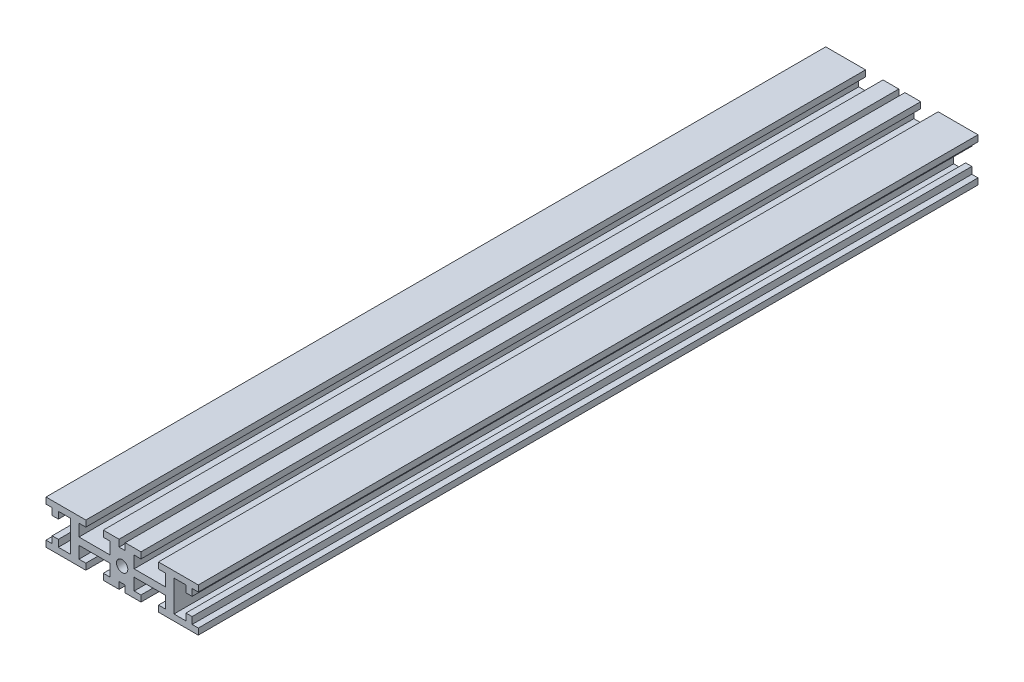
from build123d import *

# Parameters (mm, degrees)
BOSS_EXTRUDE1_DEPTH = 227.6
M4_TAPPED_HOLE1_D   = 3.3
SKETCH5_W           = 1.8
SKETCH5_H           = 2
CUT_EXTRUDE1_DEPTH  = 229.770699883


with BuildPart() as part:
    # Sketch1 → Boss-Extrude1 (new body)
    with BuildSketch(Plane.XY):
        Polygon((5.5, 6.35), (-5.5, 6.35), (-5.5, 4.55), (-3.5, 4.55), (-3.5, 1.05), (-12.6, 1.05), (-12.6, 4.55), (-10.6, 4.55), (-10.6, 6.35), (-22.225, 6.35), (-22.225, 4.55), (-20.425, 4.55), (-20.425, 2.55), (-18.625, 2.55), (-18.625, 4.55), (-15.125, 4.55), (-15.125, -4.55), (-18.625, -4.55), (-18.625, -2.55), (-20.425, -2.55), (-20.425, -4.55), (-22.225, -4.55), (-22.225, -6.35), (-10.6, -6.35), (-10.6, -4.55), (-12.6, -4.55), (-12.6, -1.05), (-3.5, -1.05), (-3.5, -4.55), (-5.5, -4.55), (-5.5, -6.35), (5.5, -6.35), (5.5, -4.55), (3.5, -4.55), (3.5, -1.05), (12.6, -1.05), (12.6, -4.55), (10.6, -4.55), (10.6, -6.35), (22.225, -6.35), (22.225, -4.55), (20.425, -4.55), (20.425, -2.55), (18.625, -2.55), (18.625, -4.55), (15.125, -4.55), (15.125, 4.55), (18.625, 4.55), (18.625, 2.55), (20.425, 2.55), (20.425, 4.55), (22.225, 4.55), (22.225, 6.35), (10.6, 6.35), (10.6, 4.55), (12.6, 4.55), (12.6, 1.05), (3.5, 1.05), (3.5, 4.55), (5.5, 4.55), align=None)
    extrude(amount=BOSS_EXTRUDE1_DEPTH)

    # M4 Tapped Hole1 (through all)
    with Locations(Plane.XY.offset(227.6)):
        with Locations((0, 0)):
            Hole(M4_TAPPED_HOLE1_D / 2)

    # Sketch5 → Cut-Extrude1 (cut, through all)
    with BuildSketch(Plane.XY.offset(227.6)):
        with Locations((0, -5.35)):
            Rectangle(SKETCH5_W, SKETCH5_H)
        with Locations((0, 5.35)):
            Rectangle(SKETCH5_W, SKETCH5_H)
    extrude(amount=-CUT_EXTRUDE1_DEPTH, mode=Mode.SUBTRACT)


solid = part.part
